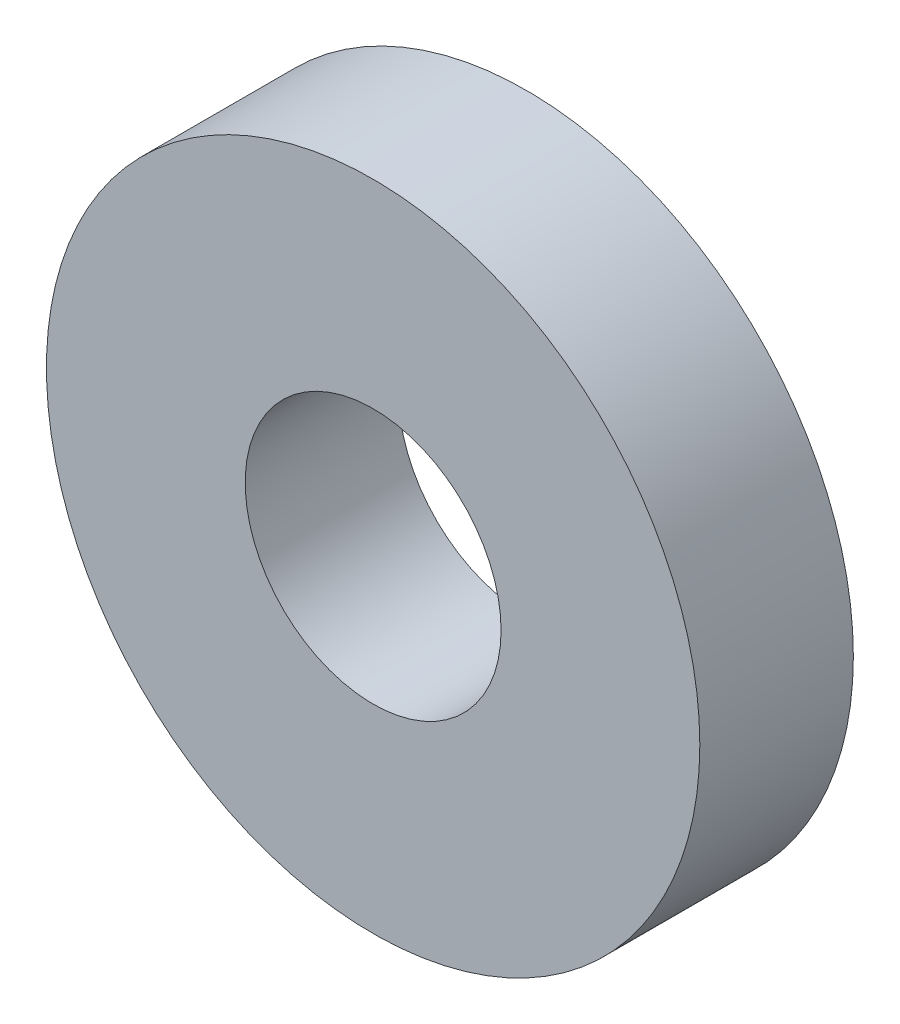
ISO-10303-21;
HEADER;
FILE_DESCRIPTION(('STEP AP214'),'2;1');
FILE_NAME('part.step','',(''),(''),'','','');
FILE_SCHEMA(('AUTOMOTIVE_DESIGN { 1 0 10303 214 1 1 1 1 }'));
ENDSEC;
DATA;
#1=APPLICATION_CONTEXT('core data for automotive mechanical design processes');
#2=APPLICATION_PROTOCOL_DEFINITION('international standard','automotive_design',2000,#1);
#3=PRODUCT_CONTEXT('',#1,'mechanical');
#4=PRODUCT('Part','Part','',(#3));
#5=PRODUCT_RELATED_PRODUCT_CATEGORY('part','',(#4));
#6=PRODUCT_DEFINITION_FORMATION('','',#4);
#7=PRODUCT_DEFINITION_CONTEXT('part definition',#1,'design');
#8=PRODUCT_DEFINITION('design','',#6,#7);
#9=PRODUCT_DEFINITION_SHAPE('','',#8);
#10=(LENGTH_UNIT() NAMED_UNIT(*) SI_UNIT(.MILLI.,.METRE.));
#11=(NAMED_UNIT(*) PLANE_ANGLE_UNIT() SI_UNIT($,.RADIAN.));
#12=(NAMED_UNIT(*) SI_UNIT($,.STERADIAN.) SOLID_ANGLE_UNIT());
#13=UNCERTAINTY_MEASURE_WITH_UNIT(LENGTH_MEASURE(1.E-05),#10,'distance_accuracy_value','');
#14=(GEOMETRIC_REPRESENTATION_CONTEXT(3) GLOBAL_UNCERTAINTY_ASSIGNED_CONTEXT((#13)) GLOBAL_UNIT_ASSIGNED_CONTEXT((#10,
#11,#12)) REPRESENTATION_CONTEXT('',''));
#15=CARTESIAN_POINT('',(0.,0.,0.));
#16=DIRECTION('',(0.,0.,1.));
#17=DIRECTION('',(1.,0.,0.));
#18=AXIS2_PLACEMENT_3D('',#15,#16,#17);
#19=CARTESIAN_POINT('',(0.,0.,0.));
#20=DIRECTION('',(0.,0.,1.));
#21=DIRECTION('',(1.,0.,0.));
#22=AXIS2_PLACEMENT_3D('',#19,#20,#21);
#23=CYLINDRICAL_SURFACE('',#22,75.);
#24=CARTESIAN_POINT('',(0.,0.,0.));
#25=DIRECTION('',(0.,0.,-1.));
#26=DIRECTION('',(-1.,0.,0.));
#27=AXIS2_PLACEMENT_3D('',#24,#25,#26);
#28=CIRCLE('',#27,75.);
#29=CARTESIAN_POINT('',(75.,0.,0.));
#30=VERTEX_POINT('',#29);
#31=EDGE_CURVE('E9',#30,#30,#28,.T.);
#32=ORIENTED_EDGE('',*,*,#31,.T.);
#33=DIRECTION('',(0.,0.,1.));
#34=VECTOR('',#33,1.);
#35=CARTESIAN_POINT('',(75.,0.,45.));
#36=LINE('',#35,#34);
#37=CARTESIAN_POINT('',(75.,0.,90.));
#38=VERTEX_POINT('',#37);
#39=EDGE_CURVE('E24',#30,#38,#36,.T.);
#40=ORIENTED_EDGE('',*,*,#39,.T.);
#41=CARTESIAN_POINT('',(0.,0.,90.));
#42=DIRECTION('',(0.,0.,1.));
#43=DIRECTION('',(1.,0.,0.));
#44=AXIS2_PLACEMENT_3D('',#41,#42,#43);
#45=CIRCLE('',#44,75.);
#46=EDGE_CURVE('E47',#38,#38,#45,.T.);
#47=ORIENTED_EDGE('',*,*,#46,.T.);
#48=ORIENTED_EDGE('',*,*,#39,.F.);
#49=EDGE_LOOP('',(#32,#40,#47,#48));
#50=FACE_BOUND('',#49,.T.);
#51=ADVANCED_FACE('F14',(#50),#23,.F.);
#52=CARTESIAN_POINT('',(0.,0.,0.));
#53=DIRECTION('',(0.,0.,1.));
#54=DIRECTION('',(1.,0.,0.));
#55=AXIS2_PLACEMENT_3D('',#52,#53,#54);
#56=CYLINDRICAL_SURFACE('',#55,191.5);
#57=CARTESIAN_POINT('',(0.,0.,0.));
#58=DIRECTION('',(0.,0.,1.));
#59=DIRECTION('',(1.,0.,0.));
#60=AXIS2_PLACEMENT_3D('',#57,#58,#59);
#61=CIRCLE('',#60,191.5);
#62=CARTESIAN_POINT('',(191.5,0.,0.));
#63=VERTEX_POINT('',#62);
#64=EDGE_CURVE('E43',#63,#63,#61,.T.);
#65=ORIENTED_EDGE('',*,*,#64,.T.);
#66=DIRECTION('',(0.,0.,-1.));
#67=VECTOR('',#66,1.);
#68=CARTESIAN_POINT('',(191.5,0.,45.));
#69=LINE('',#68,#67);
#70=CARTESIAN_POINT('',(191.5,0.,90.));
#71=VERTEX_POINT('',#70);
#72=EDGE_CURVE('E18',#71,#63,#69,.T.);
#73=ORIENTED_EDGE('',*,*,#72,.F.);
#74=CARTESIAN_POINT('',(0.,2.01304993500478E-13,90.));
#75=DIRECTION('',(0.,0.,-1.));
#76=DIRECTION('',(-1.,0.,0.));
#77=AXIS2_PLACEMENT_3D('',#74,#75,#76);
#78=CIRCLE('',#77,191.5);
#79=EDGE_CURVE('E39',#71,#71,#78,.T.);
#80=ORIENTED_EDGE('',*,*,#79,.T.);
#81=ORIENTED_EDGE('',*,*,#72,.T.);
#82=EDGE_LOOP('',(#65,#73,#80,#81));
#83=FACE_BOUND('',#82,.T.);
#84=ADVANCED_FACE('F58',(#83),#56,.T.);
#85=CARTESIAN_POINT('',(201.074987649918,-201.074987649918,90.));
#86=DIRECTION('',(0.,0.,1.));
#87=DIRECTION('',(0.,1.,0.));
#88=AXIS2_PLACEMENT_3D('',#85,#86,#87);
#89=PLANE('',#88);
#90=ORIENTED_EDGE('',*,*,#46,.F.);
#91=EDGE_LOOP('',(#90));
#92=FACE_BOUND('',#91,.T.);
#93=ORIENTED_EDGE('',*,*,#79,.F.);
#94=EDGE_LOOP('',(#93));
#95=FACE_BOUND('',#94,.T.);
#96=ADVANCED_FACE('F53',(#92,#95),#89,.T.);
#97=CARTESIAN_POINT('',(-201.074987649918,201.074987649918,0.));
#98=DIRECTION('',(0.,0.,-1.));
#99=DIRECTION('',(1.,0.,0.));
#100=AXIS2_PLACEMENT_3D('',#97,#98,#99);
#101=PLANE('',#100);
#102=ORIENTED_EDGE('',*,*,#31,.F.);
#103=EDGE_LOOP('',(#102));
#104=FACE_BOUND('',#103,.T.);
#105=ORIENTED_EDGE('',*,*,#64,.F.);
#106=EDGE_LOOP('',(#105));
#107=FACE_BOUND('',#106,.T.);
#108=ADVANCED_FACE('F16',(#104,#107),#101,.T.);
#109=CLOSED_SHELL('',(#51,#84,#96,#108));
#110=MANIFOLD_SOLID_BREP('B1',#109);
#111=ADVANCED_BREP_SHAPE_REPRESENTATION('',(#18,#110),#14);
#112=SHAPE_DEFINITION_REPRESENTATION(#9,#111);
ENDSEC;
END-ISO-10303-21;
